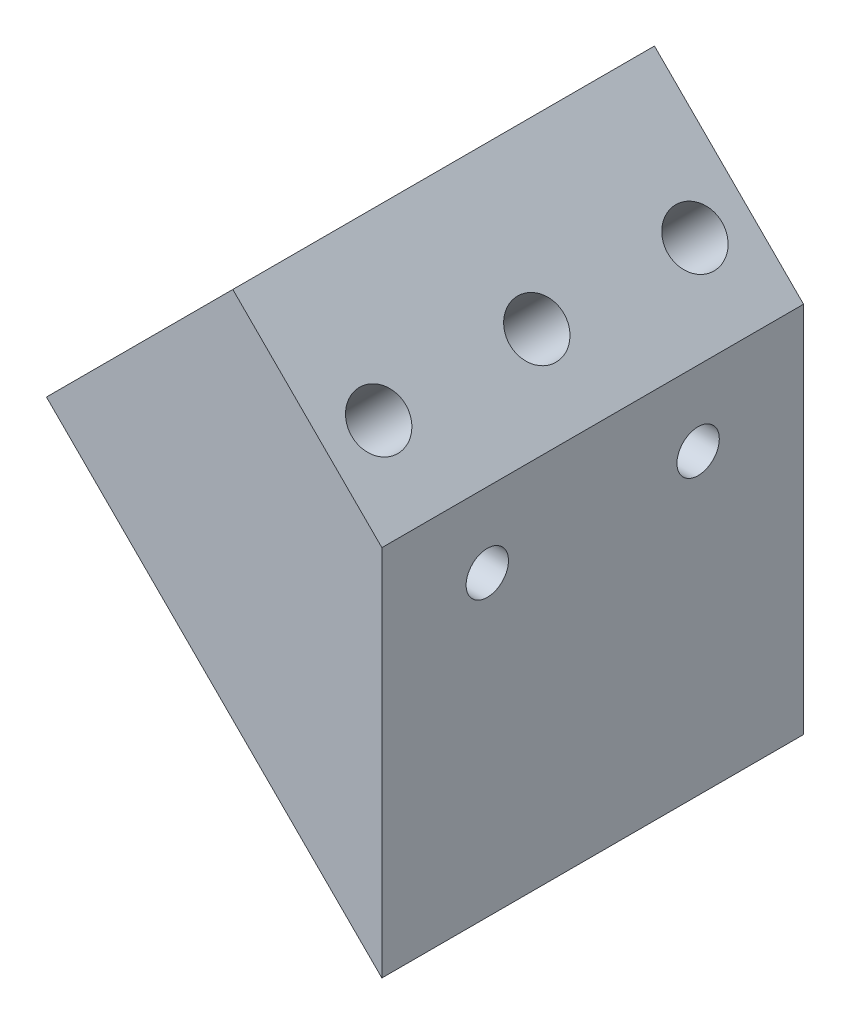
ISO-10303-21;
HEADER;
FILE_DESCRIPTION(('STEP AP214'),'2;1');
FILE_NAME('part.step','',(''),(''),'','','');
FILE_SCHEMA(('AUTOMOTIVE_DESIGN { 1 0 10303 214 1 1 1 1 }'));
ENDSEC;
DATA;
#1=APPLICATION_CONTEXT('core data for automotive mechanical design processes');
#2=APPLICATION_PROTOCOL_DEFINITION('international standard','automotive_design',2000,#1);
#3=PRODUCT_CONTEXT('',#1,'mechanical');
#4=PRODUCT('Part','Part','',(#3));
#5=PRODUCT_RELATED_PRODUCT_CATEGORY('part','',(#4));
#6=PRODUCT_DEFINITION_FORMATION('','',#4);
#7=PRODUCT_DEFINITION_CONTEXT('part definition',#1,'design');
#8=PRODUCT_DEFINITION('design','',#6,#7);
#9=PRODUCT_DEFINITION_SHAPE('','',#8);
#10=(LENGTH_UNIT() NAMED_UNIT(*) SI_UNIT(.MILLI.,.METRE.));
#11=(NAMED_UNIT(*) PLANE_ANGLE_UNIT() SI_UNIT($,.RADIAN.));
#12=(NAMED_UNIT(*) SI_UNIT($,.STERADIAN.) SOLID_ANGLE_UNIT());
#13=UNCERTAINTY_MEASURE_WITH_UNIT(LENGTH_MEASURE(1.E-05),#10,'distance_accuracy_value','');
#14=(GEOMETRIC_REPRESENTATION_CONTEXT(3) GLOBAL_UNCERTAINTY_ASSIGNED_CONTEXT((#13)) GLOBAL_UNIT_ASSIGNED_CONTEXT((#10,
#11,#12)) REPRESENTATION_CONTEXT('',''));
#15=CARTESIAN_POINT('',(0.,0.,0.));
#16=DIRECTION('',(0.,0.,1.));
#17=DIRECTION('',(1.,0.,0.));
#18=AXIS2_PLACEMENT_3D('',#15,#16,#17);
#19=CARTESIAN_POINT('',(0.,80.8223050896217,25.4));
#20=DIRECTION('',(-1.,0.,0.));
#21=DIRECTION('',(0.,0.,1.));
#22=AXIS2_PLACEMENT_3D('',#19,#20,#21);
#23=PLANE('',#22);
#24=CARTESIAN_POINT('',(0.,35.92068,12.7));
#25=DIRECTION('',(1.,0.,0.));
#26=DIRECTION('',(0.,0.,-1.));
#27=AXIS2_PLACEMENT_3D('',#24,#25,#26);
#28=CIRCLE('',#27,2.55269999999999);
#29=CARTESIAN_POINT('',(0.,35.92068,10.1473));
#30=VERTEX_POINT('',#29);
#31=EDGE_CURVE('E100',#30,#30,#28,.T.);
#32=ORIENTED_EDGE('',*,*,#31,.F.);
#33=EDGE_LOOP('',(#32));
#34=FACE_BOUND('',#33,.T.);
#35=CARTESIAN_POINT('',(0.,35.92068,-12.7));
#36=DIRECTION('',(1.,0.,0.));
#37=DIRECTION('',(0.,0.,-1.));
#38=AXIS2_PLACEMENT_3D('',#35,#36,#37);
#39=CIRCLE('',#38,2.55269999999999);
#40=CARTESIAN_POINT('',(0.,35.92068,-15.2527));
#41=VERTEX_POINT('',#40);
#42=EDGE_CURVE('E92',#41,#41,#39,.T.);
#43=ORIENTED_EDGE('',*,*,#42,.F.);
#44=EDGE_LOOP('',(#43));
#45=FACE_BOUND('',#44,.T.);
#46=DIRECTION('',(0.,1.,0.));
#47=VECTOR('',#46,1.);
#48=CARTESIAN_POINT('',(0.,80.8223050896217,-25.4));
#49=LINE('',#48,#47);
#50=CARTESIAN_POINT('',(0.,0.,-25.4));
#51=VERTEX_POINT('',#50);
#52=CARTESIAN_POINT('',(0.,44.9012806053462,-25.4));
#53=VERTEX_POINT('',#52);
#54=EDGE_CURVE('E84',#51,#53,#49,.T.);
#55=ORIENTED_EDGE('',*,*,#54,.T.);
#56=DIRECTION('',(0.,0.,1.));
#57=VECTOR('',#56,1.);
#58=CARTESIAN_POINT('',(0.,44.9012806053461,-25.4));
#59=LINE('',#58,#57);
#60=CARTESIAN_POINT('',(0.,44.9012806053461,25.4));
#61=VERTEX_POINT('',#60);
#62=EDGE_CURVE('E50',#53,#61,#59,.T.);
#63=ORIENTED_EDGE('',*,*,#62,.T.);
#64=DIRECTION('',(0.,1.,0.));
#65=VECTOR('',#64,1.);
#66=CARTESIAN_POINT('',(0.,80.8223050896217,25.4));
#67=LINE('',#66,#65);
#68=CARTESIAN_POINT('',(0.,0.,25.4));
#69=VERTEX_POINT('',#68);
#70=EDGE_CURVE('E79',#69,#61,#67,.T.);
#71=ORIENTED_EDGE('',*,*,#70,.F.);
#72=DIRECTION('',(0.,0.,-1.));
#73=VECTOR('',#72,1.);
#74=CARTESIAN_POINT('',(0.,0.,25.4));
#75=LINE('',#74,#73);
#76=EDGE_CURVE('E42',#69,#51,#75,.T.);
#77=ORIENTED_EDGE('',*,*,#76,.T.);
#78=EDGE_LOOP('',(#55,#63,#71,#77));
#79=FACE_BOUND('',#78,.T.);
#80=ADVANCED_FACE('F34',(#34,#45,#79),#23,.F.);
#81=CARTESIAN_POINT('',(-40.411152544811,40.4111525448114,25.4));
#82=DIRECTION('',(0.707106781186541,-0.707106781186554,0.));
#83=DIRECTION('',(0.707106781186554,0.707106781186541,0.));
#84=AXIS2_PLACEMENT_3D('',#81,#82,#83);
#85=PLANE('',#84);
#86=DIRECTION('',(-0.707106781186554,-0.707106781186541,0.));
#87=VECTOR('',#86,1.);
#88=CARTESIAN_POINT('',(-40.411152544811,40.4111525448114,25.4));
#89=LINE('',#88,#87);
#90=CARTESIAN_POINT('',(-17.9605122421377,62.8617928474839,25.4));
#91=VERTEX_POINT('',#90);
#92=CARTESIAN_POINT('',(-40.411152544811,40.4111525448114,25.4));
#93=VERTEX_POINT('',#92);
#94=EDGE_CURVE('E130',#91,#93,#89,.T.);
#95=ORIENTED_EDGE('',*,*,#94,.F.);
#96=DIRECTION('',(0.,0.,1.));
#97=VECTOR('',#96,1.);
#98=CARTESIAN_POINT('',(-17.9605122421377,62.8617928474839,-25.4));
#99=LINE('',#98,#97);
#100=CARTESIAN_POINT('',(-17.9605122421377,62.8617928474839,-25.4));
#101=VERTEX_POINT('',#100);
#102=EDGE_CURVE('E121',#101,#91,#99,.T.);
#103=ORIENTED_EDGE('',*,*,#102,.F.);
#104=DIRECTION('',(-0.707106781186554,-0.707106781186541,0.));
#105=VECTOR('',#104,1.);
#106=CARTESIAN_POINT('',(-40.411152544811,40.4111525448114,-25.4));
#107=LINE('',#106,#105);
#108=CARTESIAN_POINT('',(-40.411152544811,40.4111525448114,-25.4));
#109=VERTEX_POINT('',#108);
#110=EDGE_CURVE('E80',#101,#109,#107,.T.);
#111=ORIENTED_EDGE('',*,*,#110,.T.);
#112=DIRECTION('',(0.,0.,-1.));
#113=VECTOR('',#112,1.);
#114=CARTESIAN_POINT('',(-40.411152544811,40.4111525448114,25.4));
#115=LINE('',#114,#113);
#116=EDGE_CURVE('E11',#93,#109,#115,.T.);
#117=ORIENTED_EDGE('',*,*,#116,.F.);
#118=EDGE_LOOP('',(#95,#103,#111,#117));
#119=FACE_BOUND('',#118,.T.);
#120=ADVANCED_FACE('F137',(#119),#85,.F.);
#121=CARTESIAN_POINT('',(0.,0.,25.4));
#122=DIRECTION('',(0.707106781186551,0.707106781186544,0.));
#123=DIRECTION('',(-0.707106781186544,0.707106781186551,0.));
#124=AXIS2_PLACEMENT_3D('',#121,#122,#123);
#125=PLANE('',#124);
#126=CARTESIAN_POINT('',(-29.1858323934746,29.1858323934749,19.05));
#127=DIRECTION('',(0.707106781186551,0.707106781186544,0.));
#128=DIRECTION('',(-0.707106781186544,0.707106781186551,0.));
#129=AXIS2_PLACEMENT_3D('',#126,#127,#128);
#130=CIRCLE('',#129,3.26389999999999);
#131=CARTESIAN_POINT('',(-31.4937582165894,31.4937582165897,19.05));
#132=VERTEX_POINT('',#131);
#133=EDGE_CURVE('E37',#132,#132,#130,.T.);
#134=ORIENTED_EDGE('',*,*,#133,.T.);
#135=EDGE_LOOP('',(#134));
#136=FACE_BOUND('',#135,.T.);
#137=CARTESIAN_POINT('',(-29.1858323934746,29.1858323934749,-19.05));
#138=DIRECTION('',(0.707106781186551,0.707106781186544,0.));
#139=DIRECTION('',(-0.707106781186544,0.707106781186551,0.));
#140=AXIS2_PLACEMENT_3D('',#137,#138,#139);
#141=CIRCLE('',#140,3.26389999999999);
#142=CARTESIAN_POINT('',(-31.4937582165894,31.4937582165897,-19.05));
#143=VERTEX_POINT('',#142);
#144=EDGE_CURVE('E105',#143,#143,#141,.T.);
#145=ORIENTED_EDGE('',*,*,#144,.T.);
#146=EDGE_LOOP('',(#145));
#147=FACE_BOUND('',#146,.T.);
#148=CARTESIAN_POINT('',(-29.1858323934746,29.1858323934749,0.));
#149=DIRECTION('',(0.707106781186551,0.707106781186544,0.));
#150=DIRECTION('',(-0.707106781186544,0.707106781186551,0.));
#151=AXIS2_PLACEMENT_3D('',#148,#149,#150);
#152=CIRCLE('',#151,3.26389999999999);
#153=CARTESIAN_POINT('',(-31.4937582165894,31.4937582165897,0.));
#154=VERTEX_POINT('',#153);
#155=EDGE_CURVE('E101',#154,#154,#152,.T.);
#156=ORIENTED_EDGE('',*,*,#155,.T.);
#157=EDGE_LOOP('',(#156));
#158=FACE_BOUND('',#157,.T.);
#159=CARTESIAN_POINT('',(-35.9206799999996,35.92068,12.7));
#160=DIRECTION('',(0.707106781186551,0.707106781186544,0.));
#161=DIRECTION('',(0.707106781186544,-0.707106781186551,0.));
#162=AXIS2_PLACEMENT_3D('',#159,#160,#161);
#163=ELLIPSE('',#162,3.61006296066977,2.55269999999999);
#164=CARTESIAN_POINT('',(-33.3679799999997,33.36798,12.7));
#165=VERTEX_POINT('',#164);
#166=EDGE_CURVE('E97',#165,#165,#163,.T.);
#167=ORIENTED_EDGE('',*,*,#166,.T.);
#168=EDGE_LOOP('',(#167));
#169=FACE_BOUND('',#168,.T.);
#170=CARTESIAN_POINT('',(-35.9206799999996,35.92068,-12.7));
#171=DIRECTION('',(0.707106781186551,0.707106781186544,0.));
#172=DIRECTION('',(0.707106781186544,-0.707106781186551,0.));
#173=AXIS2_PLACEMENT_3D('',#170,#171,#172);
#174=ELLIPSE('',#173,3.61006296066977,2.55269999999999);
#175=CARTESIAN_POINT('',(-33.3679799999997,33.36798,-12.7));
#176=VERTEX_POINT('',#175);
#177=EDGE_CURVE('E88',#176,#176,#174,.T.);
#178=ORIENTED_EDGE('',*,*,#177,.T.);
#179=EDGE_LOOP('',(#178));
#180=FACE_BOUND('',#179,.T.);
#181=DIRECTION('',(0.707106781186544,-0.707106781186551,0.));
#182=VECTOR('',#181,1.);
#183=CARTESIAN_POINT('',(0.,0.,-25.4));
#184=LINE('',#183,#182);
#185=EDGE_CURVE('E71',#109,#51,#184,.T.);
#186=ORIENTED_EDGE('',*,*,#185,.T.);
#187=ORIENTED_EDGE('',*,*,#76,.F.);
#188=DIRECTION('',(0.707106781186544,-0.707106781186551,0.));
#189=VECTOR('',#188,1.);
#190=CARTESIAN_POINT('',(0.,0.,25.4));
#191=LINE('',#190,#189);
#192=EDGE_CURVE('E59',#93,#69,#191,.T.);
#193=ORIENTED_EDGE('',*,*,#192,.F.);
#194=ORIENTED_EDGE('',*,*,#116,.T.);
#195=EDGE_LOOP('',(#186,#187,#193,#194));
#196=FACE_BOUND('',#195,.T.);
#197=ADVANCED_FACE('F73',(#136,#147,#158,#169,#180,#196),#125,.F.);
#198=CARTESIAN_POINT('',(0.,0.,25.4));
#199=DIRECTION('',(0.,0.,-1.));
#200=DIRECTION('',(-1.,0.,0.));
#201=AXIS2_PLACEMENT_3D('',#198,#199,#200);
#202=PLANE('',#201);
#203=ORIENTED_EDGE('',*,*,#70,.T.);
#204=DIRECTION('',(0.707106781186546,-0.707106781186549,0.));
#205=VECTOR('',#204,1.);
#206=CARTESIAN_POINT('',(-17.9605122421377,62.8617928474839,25.4));
#207=LINE('',#206,#205);
#208=EDGE_CURVE('E103',#91,#61,#207,.T.);
#209=ORIENTED_EDGE('',*,*,#208,.F.);
#210=ORIENTED_EDGE('',*,*,#94,.T.);
#211=ORIENTED_EDGE('',*,*,#192,.T.);
#212=EDGE_LOOP('',(#203,#209,#210,#211));
#213=FACE_BOUND('',#212,.T.);
#214=ADVANCED_FACE('F133',(#213),#202,.F.);
#215=CARTESIAN_POINT('',(0.,0.,-25.4));
#216=DIRECTION('',(0.,0.,-1.));
#217=DIRECTION('',(-1.,0.,0.));
#218=AXIS2_PLACEMENT_3D('',#215,#216,#217);
#219=PLANE('',#218);
#220=DIRECTION('',(0.707106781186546,-0.707106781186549,0.));
#221=VECTOR('',#220,1.);
#222=CARTESIAN_POINT('',(-17.9605122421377,62.8617928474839,-25.4));
#223=LINE('',#222,#221);
#224=EDGE_CURVE('E87',#101,#53,#223,.T.);
#225=ORIENTED_EDGE('',*,*,#224,.T.);
#226=ORIENTED_EDGE('',*,*,#54,.F.);
#227=ORIENTED_EDGE('',*,*,#185,.F.);
#228=ORIENTED_EDGE('',*,*,#110,.F.);
#229=EDGE_LOOP('',(#225,#226,#227,#228));
#230=FACE_BOUND('',#229,.T.);
#231=ADVANCED_FACE('F86',(#230),#219,.T.);
#232=CARTESIAN_POINT('',(0.,35.92068,-12.7));
#233=DIRECTION('',(1.,0.,0.));
#234=DIRECTION('',(0.,0.,-1.));
#235=AXIS2_PLACEMENT_3D('',#232,#233,#234);
#236=CYLINDRICAL_SURFACE('',#235,2.55269999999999);
#237=ORIENTED_EDGE('',*,*,#42,.T.);
#238=EDGE_LOOP('',(#237));
#239=FACE_BOUND('',#238,.T.);
#240=ORIENTED_EDGE('',*,*,#177,.F.);
#241=EDGE_LOOP('',(#240));
#242=FACE_BOUND('',#241,.T.);
#243=ADVANCED_FACE('F154',(#239,#242),#236,.F.);
#244=CARTESIAN_POINT('',(0.,35.92068,12.7));
#245=DIRECTION('',(1.,0.,0.));
#246=DIRECTION('',(0.,0.,-1.));
#247=AXIS2_PLACEMENT_3D('',#244,#245,#246);
#248=CYLINDRICAL_SURFACE('',#247,2.55269999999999);
#249=ORIENTED_EDGE('',*,*,#31,.T.);
#250=EDGE_LOOP('',(#249));
#251=FACE_BOUND('',#250,.T.);
#252=ORIENTED_EDGE('',*,*,#166,.F.);
#253=EDGE_LOOP('',(#252));
#254=FACE_BOUND('',#253,.T.);
#255=ADVANCED_FACE('F144',(#251,#254),#248,.F.);
#256=CARTESIAN_POINT('',(-17.9605122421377,62.8617928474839,-25.4));
#257=DIRECTION('',(-0.707106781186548,-0.707106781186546,0.));
#258=DIRECTION('',(0.707106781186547,-0.707106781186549,0.));
#259=AXIS2_PLACEMENT_3D('',#256,#257,#258);
#260=PLANE('',#259);
#261=CARTESIAN_POINT('',(-6.7351920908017,51.6364726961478,19.05));
#262=DIRECTION('',(0.707106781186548,0.707106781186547,0.));
#263=DIRECTION('',(-0.707106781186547,0.707106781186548,0.));
#264=AXIS2_PLACEMENT_3D('',#261,#262,#263);
#265=CIRCLE('',#264,3.26389999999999);
#266=CARTESIAN_POINT('',(-9.04311791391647,53.9443985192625,19.05));
#267=VERTEX_POINT('',#266);
#268=EDGE_CURVE('E117',#267,#267,#265,.T.);
#269=ORIENTED_EDGE('',*,*,#268,.F.);
#270=EDGE_LOOP('',(#269));
#271=FACE_BOUND('',#270,.T.);
#272=CARTESIAN_POINT('',(-6.73519209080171,51.6364726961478,-19.05));
#273=DIRECTION('',(0.707106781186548,0.707106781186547,0.));
#274=DIRECTION('',(-0.707106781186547,0.707106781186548,0.));
#275=AXIS2_PLACEMENT_3D('',#272,#273,#274);
#276=CIRCLE('',#275,3.26389999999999);
#277=CARTESIAN_POINT('',(-9.04311791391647,53.9443985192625,-19.05));
#278=VERTEX_POINT('',#277);
#279=EDGE_CURVE('E107',#278,#278,#276,.T.);
#280=ORIENTED_EDGE('',*,*,#279,.F.);
#281=EDGE_LOOP('',(#280));
#282=FACE_BOUND('',#281,.T.);
#283=CARTESIAN_POINT('',(-6.7351920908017,51.6364726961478,0.));
#284=DIRECTION('',(0.707106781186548,0.707106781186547,0.));
#285=DIRECTION('',(-0.707106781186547,0.707106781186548,0.));
#286=AXIS2_PLACEMENT_3D('',#283,#284,#285);
#287=CIRCLE('',#286,3.26389999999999);
#288=CARTESIAN_POINT('',(-9.04311791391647,53.9443985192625,0.));
#289=VERTEX_POINT('',#288);
#290=EDGE_CURVE('E104',#289,#289,#287,.T.);
#291=ORIENTED_EDGE('',*,*,#290,.F.);
#292=EDGE_LOOP('',(#291));
#293=FACE_BOUND('',#292,.T.);
#294=ORIENTED_EDGE('',*,*,#208,.T.);
#295=ORIENTED_EDGE('',*,*,#62,.F.);
#296=ORIENTED_EDGE('',*,*,#224,.F.);
#297=ORIENTED_EDGE('',*,*,#102,.T.);
#298=EDGE_LOOP('',(#294,#295,#296,#297));
#299=FACE_BOUND('',#298,.T.);
#300=ADVANCED_FACE('F141',(#271,#282,#293,#299),#260,.F.);
#301=CARTESIAN_POINT('',(-6.7351920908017,51.6364726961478,0.));
#302=DIRECTION('',(0.707106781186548,0.707106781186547,0.));
#303=DIRECTION('',(-0.707106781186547,0.707106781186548,0.));
#304=AXIS2_PLACEMENT_3D('',#301,#302,#303);
#305=CYLINDRICAL_SURFACE('',#304,3.26389999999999);
#306=ORIENTED_EDGE('',*,*,#290,.T.);
#307=EDGE_LOOP('',(#306));
#308=FACE_BOUND('',#307,.T.);
#309=ORIENTED_EDGE('',*,*,#155,.F.);
#310=EDGE_LOOP('',(#309));
#311=FACE_BOUND('',#310,.T.);
#312=ADVANCED_FACE('F143',(#308,#311),#305,.F.);
#313=CARTESIAN_POINT('',(-6.73519209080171,51.6364726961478,-19.05));
#314=DIRECTION('',(0.707106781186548,0.707106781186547,0.));
#315=DIRECTION('',(-0.707106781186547,0.707106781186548,0.));
#316=AXIS2_PLACEMENT_3D('',#313,#314,#315);
#317=CYLINDRICAL_SURFACE('',#316,3.26389999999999);
#318=ORIENTED_EDGE('',*,*,#279,.T.);
#319=EDGE_LOOP('',(#318));
#320=FACE_BOUND('',#319,.T.);
#321=ORIENTED_EDGE('',*,*,#144,.F.);
#322=EDGE_LOOP('',(#321));
#323=FACE_BOUND('',#322,.T.);
#324=ADVANCED_FACE('F151',(#320,#323),#317,.F.);
#325=CARTESIAN_POINT('',(-6.7351920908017,51.6364726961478,19.05));
#326=DIRECTION('',(0.707106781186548,0.707106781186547,0.));
#327=DIRECTION('',(-0.707106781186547,0.707106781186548,0.));
#328=AXIS2_PLACEMENT_3D('',#325,#326,#327);
#329=CYLINDRICAL_SURFACE('',#328,3.26389999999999);
#330=ORIENTED_EDGE('',*,*,#268,.T.);
#331=EDGE_LOOP('',(#330));
#332=FACE_BOUND('',#331,.T.);
#333=ORIENTED_EDGE('',*,*,#133,.F.);
#334=EDGE_LOOP('',(#333));
#335=FACE_BOUND('',#334,.T.);
#336=ADVANCED_FACE('F242',(#332,#335),#329,.F.);
#337=CLOSED_SHELL('',(#80,#120,#197,#214,#231,#243,#255,#300,#312,#324,#336));
#338=MANIFOLD_SOLID_BREP('B2',#337);
#339=ADVANCED_BREP_SHAPE_REPRESENTATION('',(#18,#338),#14);
#340=SHAPE_DEFINITION_REPRESENTATION(#9,#339);
ENDSEC;
END-ISO-10303-21;
